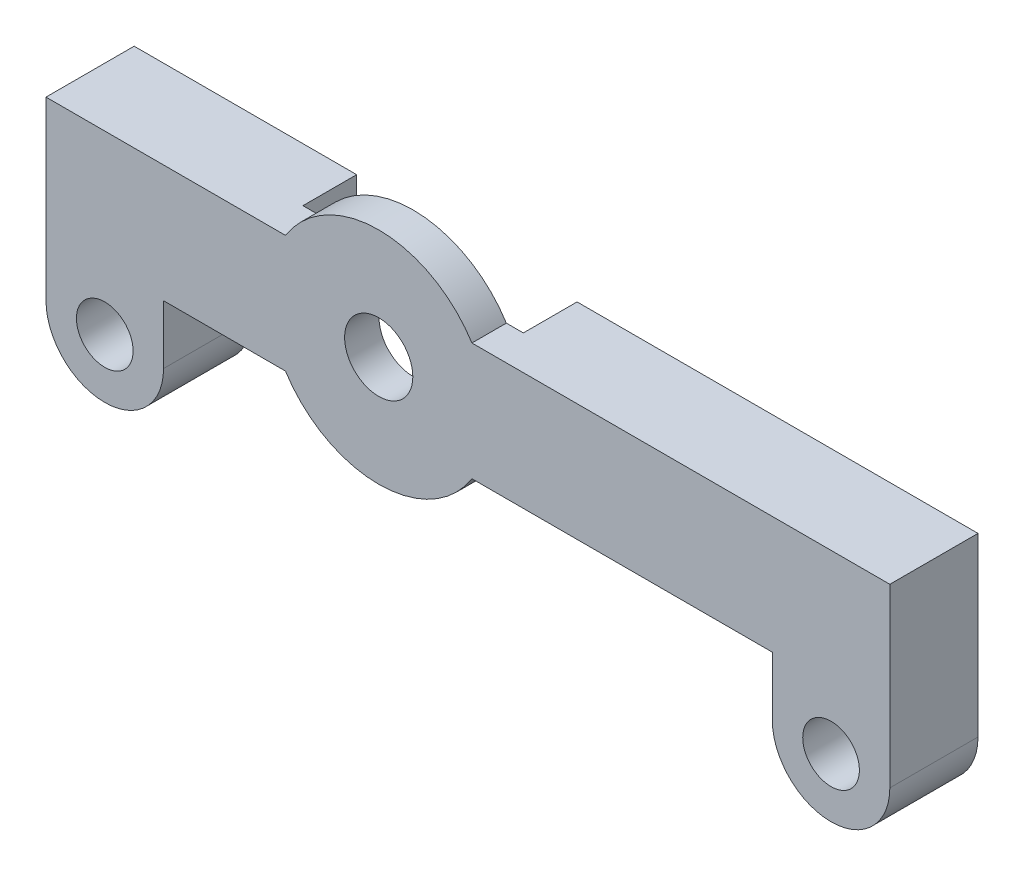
ISO-10303-21;
HEADER;
FILE_DESCRIPTION(('STEP AP214'),'2;1');
FILE_NAME('part.step','',(''),(''),'','','');
FILE_SCHEMA(('AUTOMOTIVE_DESIGN { 1 0 10303 214 1 1 1 1 }'));
ENDSEC;
DATA;
#1=APPLICATION_CONTEXT('core data for automotive mechanical design processes');
#2=APPLICATION_PROTOCOL_DEFINITION('international standard','automotive_design',2000,#1);
#3=PRODUCT_CONTEXT('',#1,'mechanical');
#4=PRODUCT('Part','Part','',(#3));
#5=PRODUCT_RELATED_PRODUCT_CATEGORY('part','',(#4));
#6=PRODUCT_DEFINITION_FORMATION('','',#4);
#7=PRODUCT_DEFINITION_CONTEXT('part definition',#1,'design');
#8=PRODUCT_DEFINITION('design','',#6,#7);
#9=PRODUCT_DEFINITION_SHAPE('','',#8);
#10=(LENGTH_UNIT() NAMED_UNIT(*) SI_UNIT(.MILLI.,.METRE.));
#11=(NAMED_UNIT(*) PLANE_ANGLE_UNIT() SI_UNIT($,.RADIAN.));
#12=(NAMED_UNIT(*) SI_UNIT($,.STERADIAN.) SOLID_ANGLE_UNIT());
#13=UNCERTAINTY_MEASURE_WITH_UNIT(LENGTH_MEASURE(1.E-05),#10,'distance_accuracy_value','');
#14=(GEOMETRIC_REPRESENTATION_CONTEXT(3) GLOBAL_UNCERTAINTY_ASSIGNED_CONTEXT((#13)) GLOBAL_UNIT_ASSIGNED_CONTEXT((#10,
#11,#12)) REPRESENTATION_CONTEXT('',''));
#15=CARTESIAN_POINT('',(0.,0.,0.));
#16=DIRECTION('',(0.,0.,1.));
#17=DIRECTION('',(1.,0.,0.));
#18=AXIS2_PLACEMENT_3D('',#15,#16,#17);
#19=CARTESIAN_POINT('',(-14.5,2.8,4.2));
#20=DIRECTION('',(0.,1.,0.));
#21=DIRECTION('',(0.,0.,1.));
#22=AXIS2_PLACEMENT_3D('',#19,#20,#21);
#23=PLANE('',#22);
#24=DIRECTION('',(-1.,0.,0.));
#25=VECTOR('',#24,1.);
#26=CARTESIAN_POINT('',(-9.5,2.8,2.56));
#27=LINE('',#26,#25);
#28=CARTESIAN_POINT('',(-8.69100213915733,2.8,2.56));
#29=VERTEX_POINT('',#28);
#30=CARTESIAN_POINT('',(-9.5,2.8,2.56));
#31=VERTEX_POINT('',#30);
#32=EDGE_CURVE('E380',#29,#31,#27,.T.);
#33=ORIENTED_EDGE('',*,*,#32,.F.);
#34=DIRECTION('',(0.,0.,1.));
#35=VECTOR('',#34,1.);
#36=CARTESIAN_POINT('',(-8.69100213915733,2.8,-12.2892424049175));
#37=LINE('',#36,#35);
#38=CARTESIAN_POINT('',(-8.69100213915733,2.8,4.2));
#39=VERTEX_POINT('',#38);
#40=EDGE_CURVE('E296',#29,#39,#37,.T.);
#41=ORIENTED_EDGE('',*,*,#40,.T.);
#42=DIRECTION('',(1.,0.,0.));
#43=VECTOR('',#42,1.);
#44=CARTESIAN_POINT('',(-14.5,2.8,4.2));
#45=LINE('',#44,#43);
#46=CARTESIAN_POINT('',(-14.5,2.8,4.2));
#47=VERTEX_POINT('',#46);
#48=EDGE_CURVE('E282',#47,#39,#45,.T.);
#49=ORIENTED_EDGE('',*,*,#48,.F.);
#50=DIRECTION('',(0.,0.,-1.));
#51=VECTOR('',#50,1.);
#52=CARTESIAN_POINT('',(-14.5,2.8,4.2));
#53=LINE('',#52,#51);
#54=CARTESIAN_POINT('',(-14.5,2.8,0.));
#55=VERTEX_POINT('',#54);
#56=EDGE_CURVE('E48',#47,#55,#53,.T.);
#57=ORIENTED_EDGE('',*,*,#56,.T.);
#58=DIRECTION('',(1.,0.,0.));
#59=VECTOR('',#58,1.);
#60=CARTESIAN_POINT('',(-14.5,2.8,0.));
#61=LINE('',#60,#59);
#62=CARTESIAN_POINT('',(-9.5,2.8,0.));
#63=VERTEX_POINT('',#62);
#64=EDGE_CURVE('E229',#55,#63,#61,.T.);
#65=ORIENTED_EDGE('',*,*,#64,.T.);
#66=DIRECTION('',(0.,0.,-1.));
#67=VECTOR('',#66,1.);
#68=CARTESIAN_POINT('',(-9.5,2.8,2.56));
#69=LINE('',#68,#67);
#70=EDGE_CURVE('E308',#31,#63,#69,.T.);
#71=ORIENTED_EDGE('',*,*,#70,.F.);
#72=EDGE_LOOP('',(#33,#41,#49,#57,#65,#71));
#73=FACE_BOUND('',#72,.T.);
#74=ADVANCED_FACE('F38',(#73),#23,.F.);
#75=CARTESIAN_POINT('',(-20.1,8.4,4.2));
#76=DIRECTION('',(0.,-1.,0.));
#77=DIRECTION('',(0.,0.,-1.));
#78=AXIS2_PLACEMENT_3D('',#75,#76,#77);
#79=PLANE('',#78);
#80=DIRECTION('',(1.,0.,0.));
#81=VECTOR('',#80,1.);
#82=CARTESIAN_POINT('',(-9.5,8.4,2.56));
#83=LINE('',#82,#81);
#84=CARTESIAN_POINT('',(0.191002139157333,8.4,2.56));
#85=VERTEX_POINT('',#84);
#86=CARTESIAN_POINT('',(1.,8.4,2.56));
#87=VERTEX_POINT('',#86);
#88=EDGE_CURVE('E199',#85,#87,#83,.T.);
#89=ORIENTED_EDGE('',*,*,#88,.F.);
#90=DIRECTION('',(0.,0.,1.));
#91=VECTOR('',#90,1.);
#92=CARTESIAN_POINT('',(0.191002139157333,8.4,-12.2892424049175));
#93=LINE('',#92,#91);
#94=CARTESIAN_POINT('',(0.191002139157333,8.4,4.2));
#95=VERTEX_POINT('',#94);
#96=EDGE_CURVE('E183',#85,#95,#93,.T.);
#97=ORIENTED_EDGE('',*,*,#96,.T.);
#98=DIRECTION('',(-1.,0.,0.));
#99=VECTOR('',#98,1.);
#100=CARTESIAN_POINT('',(-20.1,8.4,4.2));
#101=LINE('',#100,#99);
#102=CARTESIAN_POINT('',(20.1,8.4,4.2));
#103=VERTEX_POINT('',#102);
#104=EDGE_CURVE('E197',#103,#95,#101,.T.);
#105=ORIENTED_EDGE('',*,*,#104,.F.);
#106=DIRECTION('',(0.,0.,-1.));
#107=VECTOR('',#106,1.);
#108=CARTESIAN_POINT('',(20.1,8.4,4.2));
#109=LINE('',#108,#107);
#110=CARTESIAN_POINT('',(20.1,8.4,0.));
#111=VERTEX_POINT('',#110);
#112=EDGE_CURVE('E256',#103,#111,#109,.T.);
#113=ORIENTED_EDGE('',*,*,#112,.T.);
#114=DIRECTION('',(-1.,0.,0.));
#115=VECTOR('',#114,1.);
#116=CARTESIAN_POINT('',(-20.1,8.4,0.));
#117=LINE('',#116,#115);
#118=CARTESIAN_POINT('',(1.,8.4,0.));
#119=VERTEX_POINT('',#118);
#120=EDGE_CURVE('E243',#111,#119,#117,.T.);
#121=ORIENTED_EDGE('',*,*,#120,.T.);
#122=DIRECTION('',(0.,0.,-1.));
#123=VECTOR('',#122,1.);
#124=CARTESIAN_POINT('',(1.,8.4,2.56));
#125=LINE('',#124,#123);
#126=EDGE_CURVE('E315',#87,#119,#125,.T.);
#127=ORIENTED_EDGE('',*,*,#126,.F.);
#128=EDGE_LOOP('',(#89,#97,#105,#113,#121,#127));
#129=FACE_BOUND('',#128,.T.);
#130=ADVANCED_FACE('F195',(#129),#79,.F.);
#131=CARTESIAN_POINT('',(-17.3,0.,0.));
#132=DIRECTION('',(0.,0.,1.));
#133=DIRECTION('',(1.,0.,0.));
#134=AXIS2_PLACEMENT_3D('',#131,#132,#133);
#135=PLANE('',#134);
#136=CARTESIAN_POINT('',(-17.3,0.,0.));
#137=DIRECTION('',(0.,0.,1.));
#138=DIRECTION('',(1.,0.,0.));
#139=AXIS2_PLACEMENT_3D('',#136,#137,#138);
#140=CIRCLE('',#139,1.35);
#141=CARTESIAN_POINT('',(-15.95,0.,0.));
#142=VERTEX_POINT('',#141);
#143=EDGE_CURVE('E332',#142,#142,#140,.T.);
#144=ORIENTED_EDGE('',*,*,#143,.T.);
#145=EDGE_LOOP('',(#144));
#146=FACE_BOUND('',#145,.T.);
#147=CARTESIAN_POINT('',(-9.5,8.4,0.));
#148=VERTEX_POINT('',#147);
#149=CARTESIAN_POINT('',(-20.1,8.4,0.));
#150=VERTEX_POINT('',#149);
#151=EDGE_CURVE('E242',#148,#150,#117,.T.);
#152=ORIENTED_EDGE('',*,*,#151,.F.);
#153=DIRECTION('',(0.,1.,0.));
#154=VECTOR('',#153,1.);
#155=CARTESIAN_POINT('',(-9.5,2.8,0.));
#156=LINE('',#155,#154);
#157=EDGE_CURVE('E289',#63,#148,#156,.T.);
#158=ORIENTED_EDGE('',*,*,#157,.F.);
#159=ORIENTED_EDGE('',*,*,#64,.F.);
#160=DIRECTION('',(0.,1.,0.));
#161=VECTOR('',#160,1.);
#162=CARTESIAN_POINT('',(-14.5,0.,0.));
#163=LINE('',#162,#161);
#164=CARTESIAN_POINT('',(-14.5,0.,0.));
#165=VERTEX_POINT('',#164);
#166=EDGE_CURVE('E224',#165,#55,#163,.T.);
#167=ORIENTED_EDGE('',*,*,#166,.F.);
#168=CARTESIAN_POINT('',(-17.3,0.,0.));
#169=DIRECTION('',(0.,0.,1.));
#170=DIRECTION('',(1.,0.,0.));
#171=AXIS2_PLACEMENT_3D('',#168,#169,#170);
#172=CIRCLE('',#171,2.8);
#173=CARTESIAN_POINT('',(-20.1,0.,0.));
#174=VERTEX_POINT('',#173);
#175=EDGE_CURVE('E220',#174,#165,#172,.T.);
#176=ORIENTED_EDGE('',*,*,#175,.F.);
#177=DIRECTION('',(0.,-1.,0.));
#178=VECTOR('',#177,1.);
#179=CARTESIAN_POINT('',(-20.1,0.,0.));
#180=LINE('',#179,#178);
#181=EDGE_CURVE('E247',#150,#174,#180,.T.);
#182=ORIENTED_EDGE('',*,*,#181,.F.);
#183=EDGE_LOOP('',(#152,#158,#159,#167,#176,#182));
#184=FACE_BOUND('',#183,.T.);
#185=ADVANCED_FACE('F287',(#146,#184),#135,.F.);
#186=CARTESIAN_POINT('',(-4.25,5.6,4.2));
#187=DIRECTION('',(0.,0.,-1.));
#188=DIRECTION('',(-1.,0.,0.));
#189=AXIS2_PLACEMENT_3D('',#186,#187,#188);
#190=CYLINDRICAL_SURFACE('',#189,1.625);
#191=CARTESIAN_POINT('',(-4.25,5.6,4.2));
#192=DIRECTION('',(0.,0.,1.));
#193=DIRECTION('',(1.,0.,0.));
#194=AXIS2_PLACEMENT_3D('',#191,#192,#193);
#195=CIRCLE('',#194,1.625);
#196=CARTESIAN_POINT('',(-2.625,5.6,4.2));
#197=VERTEX_POINT('',#196);
#198=EDGE_CURVE('E325',#197,#197,#195,.T.);
#199=ORIENTED_EDGE('',*,*,#198,.T.);
#200=EDGE_LOOP('',(#199));
#201=FACE_BOUND('',#200,.T.);
#202=CARTESIAN_POINT('',(-4.25,5.6,2.56));
#203=DIRECTION('',(0.,0.,-1.));
#204=DIRECTION('',(-1.,0.,0.));
#205=AXIS2_PLACEMENT_3D('',#202,#203,#204);
#206=CIRCLE('',#205,1.625);
#207=CARTESIAN_POINT('',(-5.875,5.6,2.56));
#208=VERTEX_POINT('',#207);
#209=EDGE_CURVE('E42',#208,#208,#206,.T.);
#210=ORIENTED_EDGE('',*,*,#209,.T.);
#211=EDGE_LOOP('',(#210));
#212=FACE_BOUND('',#211,.T.);
#213=ADVANCED_FACE('F453',(#201,#212),#190,.F.);
#214=CARTESIAN_POINT('',(-17.3,0.,4.2));
#215=DIRECTION('',(0.,0.,1.));
#216=DIRECTION('',(1.,0.,0.));
#217=AXIS2_PLACEMENT_3D('',#214,#215,#216);
#218=PLANE('',#217);
#219=ORIENTED_EDGE('',*,*,#104,.T.);
#220=CARTESIAN_POINT('',(-4.25,5.6,4.2));
#221=DIRECTION('',(0.,0.,1.));
#222=DIRECTION('',(1.,0.,0.));
#223=AXIS2_PLACEMENT_3D('',#220,#221,#222);
#224=CIRCLE('',#223,5.25);
#225=CARTESIAN_POINT('',(-8.69100213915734,8.4,4.2));
#226=VERTEX_POINT('',#225);
#227=EDGE_CURVE('E180',#95,#226,#224,.T.);
#228=ORIENTED_EDGE('',*,*,#227,.T.);
#229=CARTESIAN_POINT('',(-20.1,8.4,4.2));
#230=VERTEX_POINT('',#229);
#231=EDGE_CURVE('E210',#226,#230,#101,.T.);
#232=ORIENTED_EDGE('',*,*,#231,.T.);
#233=DIRECTION('',(0.,-1.,0.));
#234=VECTOR('',#233,1.);
#235=CARTESIAN_POINT('',(-20.1,0.,4.2));
#236=LINE('',#235,#234);
#237=CARTESIAN_POINT('',(-20.1,0.,4.2));
#238=VERTEX_POINT('',#237);
#239=EDGE_CURVE('E209',#230,#238,#236,.T.);
#240=ORIENTED_EDGE('',*,*,#239,.T.);
#241=CARTESIAN_POINT('',(-17.3,0.,4.2));
#242=DIRECTION('',(0.,0.,1.));
#243=DIRECTION('',(1.,0.,0.));
#244=AXIS2_PLACEMENT_3D('',#241,#242,#243);
#245=CIRCLE('',#244,2.8);
#246=CARTESIAN_POINT('',(-14.5,0.,4.2));
#247=VERTEX_POINT('',#246);
#248=EDGE_CURVE('E249',#238,#247,#245,.T.);
#249=ORIENTED_EDGE('',*,*,#248,.T.);
#250=DIRECTION('',(0.,1.,0.));
#251=VECTOR('',#250,1.);
#252=CARTESIAN_POINT('',(-14.5,0.,4.2));
#253=LINE('',#252,#251);
#254=EDGE_CURVE('E341',#247,#47,#253,.T.);
#255=ORIENTED_EDGE('',*,*,#254,.T.);
#256=ORIENTED_EDGE('',*,*,#48,.T.);
#257=CARTESIAN_POINT('',(0.191002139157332,2.8,4.2));
#258=VERTEX_POINT('',#257);
#259=EDGE_CURVE('E191',#39,#258,#224,.T.);
#260=ORIENTED_EDGE('',*,*,#259,.T.);
#261=CARTESIAN_POINT('',(14.5,2.8,4.2));
#262=VERTEX_POINT('',#261);
#263=EDGE_CURVE('E344',#258,#262,#45,.T.);
#264=ORIENTED_EDGE('',*,*,#263,.T.);
#265=DIRECTION('',(0.,-1.,0.));
#266=VECTOR('',#265,1.);
#267=CARTESIAN_POINT('',(14.5,0.,4.2));
#268=LINE('',#267,#266);
#269=CARTESIAN_POINT('',(14.5,0.,4.2));
#270=VERTEX_POINT('',#269);
#271=EDGE_CURVE('E347',#262,#270,#268,.T.);
#272=ORIENTED_EDGE('',*,*,#271,.T.);
#273=CARTESIAN_POINT('',(17.3,0.,4.2));
#274=DIRECTION('',(0.,0.,1.));
#275=DIRECTION('',(-1.,0.,0.));
#276=AXIS2_PLACEMENT_3D('',#273,#274,#275);
#277=CIRCLE('',#276,2.8);
#278=CARTESIAN_POINT('',(20.1,0.,4.2));
#279=VERTEX_POINT('',#278);
#280=EDGE_CURVE('E349',#270,#279,#277,.T.);
#281=ORIENTED_EDGE('',*,*,#280,.T.);
#282=DIRECTION('',(0.,1.,0.));
#283=VECTOR('',#282,1.);
#284=CARTESIAN_POINT('',(20.1,0.,4.2));
#285=LINE('',#284,#283);
#286=EDGE_CURVE('E206',#279,#103,#285,.T.);
#287=ORIENTED_EDGE('',*,*,#286,.T.);
#288=EDGE_LOOP('',(#219,#228,#232,#240,#249,#255,#256,#260,#264,#272,#281,#287));
#289=FACE_BOUND('',#288,.T.);
#290=CARTESIAN_POINT('',(17.3,0.,4.2));
#291=DIRECTION('',(0.,0.,1.));
#292=DIRECTION('',(-1.,0.,0.));
#293=AXIS2_PLACEMENT_3D('',#290,#291,#292);
#294=CIRCLE('',#293,1.35);
#295=CARTESIAN_POINT('',(15.95,0.,4.2));
#296=VERTEX_POINT('',#295);
#297=EDGE_CURVE('E321',#296,#296,#294,.T.);
#298=ORIENTED_EDGE('',*,*,#297,.F.);
#299=EDGE_LOOP('',(#298));
#300=FACE_BOUND('',#299,.T.);
#301=ORIENTED_EDGE('',*,*,#198,.F.);
#302=EDGE_LOOP('',(#301));
#303=FACE_BOUND('',#302,.T.);
#304=CARTESIAN_POINT('',(-17.3,0.,4.2));
#305=DIRECTION('',(0.,0.,1.));
#306=DIRECTION('',(1.,0.,0.));
#307=AXIS2_PLACEMENT_3D('',#304,#305,#306);
#308=CIRCLE('',#307,1.35);
#309=CARTESIAN_POINT('',(-15.95,0.,4.2));
#310=VERTEX_POINT('',#309);
#311=EDGE_CURVE('E225',#310,#310,#308,.T.);
#312=ORIENTED_EDGE('',*,*,#311,.F.);
#313=EDGE_LOOP('',(#312));
#314=FACE_BOUND('',#313,.T.);
#315=ADVANCED_FACE('F203',(#289,#300,#303,#314),#218,.T.);
#316=CARTESIAN_POINT('',(1.,2.8,0.));
#317=VERTEX_POINT('',#316);
#318=CARTESIAN_POINT('',(14.5,2.8,0.));
#319=VERTEX_POINT('',#318);
#320=EDGE_CURVE('E228',#317,#319,#61,.T.);
#321=ORIENTED_EDGE('',*,*,#320,.F.);
#322=DIRECTION('',(0.,-1.,0.));
#323=VECTOR('',#322,1.);
#324=CARTESIAN_POINT('',(1.,2.8,0.));
#325=LINE('',#324,#323);
#326=EDGE_CURVE('E295',#119,#317,#325,.T.);
#327=ORIENTED_EDGE('',*,*,#326,.F.);
#328=ORIENTED_EDGE('',*,*,#120,.F.);
#329=DIRECTION('',(0.,1.,0.));
#330=VECTOR('',#329,1.);
#331=CARTESIAN_POINT('',(20.1,0.,0.));
#332=LINE('',#331,#330);
#333=CARTESIAN_POINT('',(20.1,0.,0.));
#334=VERTEX_POINT('',#333);
#335=EDGE_CURVE('E239',#334,#111,#332,.T.);
#336=ORIENTED_EDGE('',*,*,#335,.F.);
#337=CARTESIAN_POINT('',(17.3,0.,0.));
#338=DIRECTION('',(0.,0.,1.));
#339=DIRECTION('',(-1.,0.,0.));
#340=AXIS2_PLACEMENT_3D('',#337,#338,#339);
#341=CIRCLE('',#340,2.8);
#342=CARTESIAN_POINT('',(14.5,0.,0.));
#343=VERTEX_POINT('',#342);
#344=EDGE_CURVE('E236',#343,#334,#341,.T.);
#345=ORIENTED_EDGE('',*,*,#344,.F.);
#346=DIRECTION('',(0.,-1.,0.));
#347=VECTOR('',#346,1.);
#348=CARTESIAN_POINT('',(14.5,0.,0.));
#349=LINE('',#348,#347);
#350=EDGE_CURVE('E233',#319,#343,#349,.T.);
#351=ORIENTED_EDGE('',*,*,#350,.F.);
#352=EDGE_LOOP('',(#321,#327,#328,#336,#345,#351));
#353=FACE_BOUND('',#352,.T.);
#354=CARTESIAN_POINT('',(17.3,0.,0.));
#355=DIRECTION('',(0.,0.,1.));
#356=DIRECTION('',(-1.,0.,0.));
#357=AXIS2_PLACEMENT_3D('',#354,#355,#356);
#358=CIRCLE('',#357,1.35);
#359=CARTESIAN_POINT('',(15.95,0.,0.));
#360=VERTEX_POINT('',#359);
#361=EDGE_CURVE('E326',#360,#360,#358,.T.);
#362=ORIENTED_EDGE('',*,*,#361,.T.);
#363=EDGE_LOOP('',(#362));
#364=FACE_BOUND('',#363,.T.);
#365=ADVANCED_FACE('F366',(#353,#364),#135,.F.);
#366=CARTESIAN_POINT('',(-17.3,0.,4.2));
#367=DIRECTION('',(0.,0.,-1.));
#368=DIRECTION('',(-1.,0.,0.));
#369=AXIS2_PLACEMENT_3D('',#366,#367,#368);
#370=CYLINDRICAL_SURFACE('',#369,2.8);
#371=ORIENTED_EDGE('',*,*,#175,.T.);
#372=DIRECTION('',(0.,0.,-1.));
#373=VECTOR('',#372,1.);
#374=CARTESIAN_POINT('',(-14.5,0.,4.2));
#375=LINE('',#374,#373);
#376=EDGE_CURVE('E11',#247,#165,#375,.T.);
#377=ORIENTED_EDGE('',*,*,#376,.F.);
#378=ORIENTED_EDGE('',*,*,#248,.F.);
#379=DIRECTION('',(0.,0.,-1.));
#380=VECTOR('',#379,1.);
#381=CARTESIAN_POINT('',(-20.1,0.,4.2));
#382=LINE('',#381,#380);
#383=EDGE_CURVE('E214',#238,#174,#382,.T.);
#384=ORIENTED_EDGE('',*,*,#383,.T.);
#385=EDGE_LOOP('',(#371,#377,#378,#384));
#386=FACE_BOUND('',#385,.T.);
#387=ADVANCED_FACE('F40',(#386),#370,.T.);
#388=CARTESIAN_POINT('',(-14.5,0.,4.2));
#389=DIRECTION('',(-1.,0.,0.));
#390=DIRECTION('',(0.,0.,1.));
#391=AXIS2_PLACEMENT_3D('',#388,#389,#390);
#392=PLANE('',#391);
#393=ORIENTED_EDGE('',*,*,#166,.T.);
#394=ORIENTED_EDGE('',*,*,#56,.F.);
#395=ORIENTED_EDGE('',*,*,#254,.F.);
#396=ORIENTED_EDGE('',*,*,#376,.T.);
#397=EDGE_LOOP('',(#393,#394,#395,#396));
#398=FACE_BOUND('',#397,.T.);
#399=ADVANCED_FACE('F410',(#398),#392,.F.);
#400=ORIENTED_EDGE('',*,*,#263,.F.);
#401=DIRECTION('',(0.,0.,1.));
#402=VECTOR('',#401,1.);
#403=CARTESIAN_POINT('',(0.191002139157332,2.8,-12.2892424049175));
#404=LINE('',#403,#402);
#405=CARTESIAN_POINT('',(0.191002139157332,2.8,2.56));
#406=VERTEX_POINT('',#405);
#407=EDGE_CURVE('E201',#258,#406,#404,.F.);
#408=ORIENTED_EDGE('',*,*,#407,.T.);
#409=CARTESIAN_POINT('',(1.,2.8,2.56));
#410=VERTEX_POINT('',#409);
#411=EDGE_CURVE('E305',#410,#406,#27,.T.);
#412=ORIENTED_EDGE('',*,*,#411,.F.);
#413=DIRECTION('',(0.,0.,-1.));
#414=VECTOR('',#413,1.);
#415=CARTESIAN_POINT('',(1.,2.8,2.56));
#416=LINE('',#415,#414);
#417=EDGE_CURVE('E311',#410,#317,#416,.T.);
#418=ORIENTED_EDGE('',*,*,#417,.T.);
#419=ORIENTED_EDGE('',*,*,#320,.T.);
#420=DIRECTION('',(0.,0.,-1.));
#421=VECTOR('',#420,1.);
#422=CARTESIAN_POINT('',(14.5,2.8,4.2));
#423=LINE('',#422,#421);
#424=EDGE_CURVE('E267',#262,#319,#423,.T.);
#425=ORIENTED_EDGE('',*,*,#424,.F.);
#426=EDGE_LOOP('',(#400,#408,#412,#418,#419,#425));
#427=FACE_BOUND('',#426,.T.);
#428=ADVANCED_FACE('F376',(#427),#23,.F.);
#429=CARTESIAN_POINT('',(14.5,0.,4.2));
#430=DIRECTION('',(1.,0.,0.));
#431=DIRECTION('',(0.,0.,-1.));
#432=AXIS2_PLACEMENT_3D('',#429,#430,#431);
#433=PLANE('',#432);
#434=ORIENTED_EDGE('',*,*,#350,.T.);
#435=DIRECTION('',(0.,0.,-1.));
#436=VECTOR('',#435,1.);
#437=CARTESIAN_POINT('',(14.5,0.,4.2));
#438=LINE('',#437,#436);
#439=EDGE_CURVE('E263',#270,#343,#438,.T.);
#440=ORIENTED_EDGE('',*,*,#439,.F.);
#441=ORIENTED_EDGE('',*,*,#271,.F.);
#442=ORIENTED_EDGE('',*,*,#424,.T.);
#443=EDGE_LOOP('',(#434,#440,#441,#442));
#444=FACE_BOUND('',#443,.T.);
#445=ADVANCED_FACE('F402',(#444),#433,.F.);
#446=CARTESIAN_POINT('',(17.3,0.,4.2));
#447=DIRECTION('',(0.,0.,-1.));
#448=DIRECTION('',(-1.,0.,0.));
#449=AXIS2_PLACEMENT_3D('',#446,#447,#448);
#450=CYLINDRICAL_SURFACE('',#449,2.8);
#451=ORIENTED_EDGE('',*,*,#344,.T.);
#452=DIRECTION('',(0.,0.,-1.));
#453=VECTOR('',#452,1.);
#454=CARTESIAN_POINT('',(20.1,0.,4.2));
#455=LINE('',#454,#453);
#456=EDGE_CURVE('E259',#279,#334,#455,.T.);
#457=ORIENTED_EDGE('',*,*,#456,.F.);
#458=ORIENTED_EDGE('',*,*,#280,.F.);
#459=ORIENTED_EDGE('',*,*,#439,.T.);
#460=EDGE_LOOP('',(#451,#457,#458,#459));
#461=FACE_BOUND('',#460,.T.);
#462=ADVANCED_FACE('F357',(#461),#450,.T.);
#463=CARTESIAN_POINT('',(20.1,0.,4.2));
#464=DIRECTION('',(-1.,0.,0.));
#465=DIRECTION('',(0.,0.,1.));
#466=AXIS2_PLACEMENT_3D('',#463,#464,#465);
#467=PLANE('',#466);
#468=ORIENTED_EDGE('',*,*,#335,.T.);
#469=ORIENTED_EDGE('',*,*,#112,.F.);
#470=ORIENTED_EDGE('',*,*,#286,.F.);
#471=ORIENTED_EDGE('',*,*,#456,.T.);
#472=EDGE_LOOP('',(#468,#469,#470,#471));
#473=FACE_BOUND('',#472,.T.);
#474=ADVANCED_FACE('F361',(#473),#467,.F.);
#475=ORIENTED_EDGE('',*,*,#231,.F.);
#476=DIRECTION('',(0.,0.,1.));
#477=VECTOR('',#476,1.);
#478=CARTESIAN_POINT('',(-8.69100213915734,8.4,-12.2892424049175));
#479=LINE('',#478,#477);
#480=CARTESIAN_POINT('',(-8.69100213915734,8.4,2.56));
#481=VERTEX_POINT('',#480);
#482=EDGE_CURVE('E186',#226,#481,#479,.F.);
#483=ORIENTED_EDGE('',*,*,#482,.T.);
#484=CARTESIAN_POINT('',(-9.5,8.4,2.56));
#485=VERTEX_POINT('',#484);
#486=EDGE_CURVE('E388',#485,#481,#83,.T.);
#487=ORIENTED_EDGE('',*,*,#486,.F.);
#488=DIRECTION('',(0.,0.,-1.));
#489=VECTOR('',#488,1.);
#490=CARTESIAN_POINT('',(-9.5,8.4,2.56));
#491=LINE('',#490,#489);
#492=EDGE_CURVE('E318',#485,#148,#491,.T.);
#493=ORIENTED_EDGE('',*,*,#492,.T.);
#494=ORIENTED_EDGE('',*,*,#151,.T.);
#495=DIRECTION('',(0.,0.,-1.));
#496=VECTOR('',#495,1.);
#497=CARTESIAN_POINT('',(-20.1,8.4,4.2));
#498=LINE('',#497,#496);
#499=EDGE_CURVE('E253',#230,#150,#498,.T.);
#500=ORIENTED_EDGE('',*,*,#499,.F.);
#501=EDGE_LOOP('',(#475,#483,#487,#493,#494,#500));
#502=FACE_BOUND('',#501,.T.);
#503=ADVANCED_FACE('F417',(#502),#79,.F.);
#504=CARTESIAN_POINT('',(-20.1,0.,4.2));
#505=DIRECTION('',(1.,0.,0.));
#506=DIRECTION('',(0.,0.,-1.));
#507=AXIS2_PLACEMENT_3D('',#504,#505,#506);
#508=PLANE('',#507);
#509=ORIENTED_EDGE('',*,*,#181,.T.);
#510=ORIENTED_EDGE('',*,*,#383,.F.);
#511=ORIENTED_EDGE('',*,*,#239,.F.);
#512=ORIENTED_EDGE('',*,*,#499,.T.);
#513=EDGE_LOOP('',(#509,#510,#511,#512));
#514=FACE_BOUND('',#513,.T.);
#515=ADVANCED_FACE('F427',(#514),#508,.F.);
#516=CARTESIAN_POINT('',(-17.3,0.,4.2));
#517=DIRECTION('',(0.,0.,-1.));
#518=DIRECTION('',(-1.,0.,0.));
#519=AXIS2_PLACEMENT_3D('',#516,#517,#518);
#520=CYLINDRICAL_SURFACE('',#519,1.35);
#521=ORIENTED_EDGE('',*,*,#311,.T.);
#522=EDGE_LOOP('',(#521));
#523=FACE_BOUND('',#522,.T.);
#524=ORIENTED_EDGE('',*,*,#143,.F.);
#525=EDGE_LOOP('',(#524));
#526=FACE_BOUND('',#525,.T.);
#527=ADVANCED_FACE('F451',(#523,#526),#520,.F.);
#528=CARTESIAN_POINT('',(17.3,0.,4.2));
#529=DIRECTION('',(0.,0.,-1.));
#530=DIRECTION('',(-1.,0.,0.));
#531=AXIS2_PLACEMENT_3D('',#528,#529,#530);
#532=CYLINDRICAL_SURFACE('',#531,1.35);
#533=ORIENTED_EDGE('',*,*,#297,.T.);
#534=EDGE_LOOP('',(#533));
#535=FACE_BOUND('',#534,.T.);
#536=ORIENTED_EDGE('',*,*,#361,.F.);
#537=EDGE_LOOP('',(#536));
#538=FACE_BOUND('',#537,.T.);
#539=ADVANCED_FACE('F448',(#535,#538),#532,.F.);
#540=CARTESIAN_POINT('',(-9.5,2.8,2.56));
#541=DIRECTION('',(-1.,0.,0.));
#542=DIRECTION('',(0.,0.,1.));
#543=AXIS2_PLACEMENT_3D('',#540,#541,#542);
#544=PLANE('',#543);
#545=ORIENTED_EDGE('',*,*,#157,.T.);
#546=ORIENTED_EDGE('',*,*,#492,.F.);
#547=DIRECTION('',(0.,1.,0.));
#548=VECTOR('',#547,1.);
#549=CARTESIAN_POINT('',(-9.5,2.8,2.56));
#550=LINE('',#549,#548);
#551=EDGE_CURVE('E300',#31,#485,#550,.T.);
#552=ORIENTED_EDGE('',*,*,#551,.F.);
#553=ORIENTED_EDGE('',*,*,#70,.T.);
#554=EDGE_LOOP('',(#545,#546,#552,#553));
#555=FACE_BOUND('',#554,.T.);
#556=ADVANCED_FACE('F433',(#555),#544,.F.);
#557=CARTESIAN_POINT('',(1.,2.8,2.56));
#558=DIRECTION('',(1.,0.,0.));
#559=DIRECTION('',(0.,0.,-1.));
#560=AXIS2_PLACEMENT_3D('',#557,#558,#559);
#561=PLANE('',#560);
#562=ORIENTED_EDGE('',*,*,#326,.T.);
#563=ORIENTED_EDGE('',*,*,#417,.F.);
#564=DIRECTION('',(0.,-1.,0.));
#565=VECTOR('',#564,1.);
#566=CARTESIAN_POINT('',(1.,2.8,2.56));
#567=LINE('',#566,#565);
#568=EDGE_CURVE('E384',#87,#410,#567,.T.);
#569=ORIENTED_EDGE('',*,*,#568,.F.);
#570=ORIENTED_EDGE('',*,*,#126,.T.);
#571=EDGE_LOOP('',(#562,#563,#569,#570));
#572=FACE_BOUND('',#571,.T.);
#573=ADVANCED_FACE('F371',(#572),#561,.F.);
#574=CARTESIAN_POINT('',(0.,0.,2.56));
#575=DIRECTION('',(0.,0.,-1.));
#576=DIRECTION('',(-1.,0.,0.));
#577=AXIS2_PLACEMENT_3D('',#574,#575,#576);
#578=PLANE('',#577);
#579=ORIENTED_EDGE('',*,*,#551,.T.);
#580=ORIENTED_EDGE('',*,*,#486,.T.);
#581=CARTESIAN_POINT('',(-4.25,5.6,2.56));
#582=DIRECTION('',(0.,0.,-1.));
#583=DIRECTION('',(-1.,0.,0.));
#584=AXIS2_PLACEMENT_3D('',#581,#582,#583);
#585=CIRCLE('',#584,5.25);
#586=EDGE_CURVE('E68',#85,#481,#585,.F.);
#587=ORIENTED_EDGE('',*,*,#586,.F.);
#588=ORIENTED_EDGE('',*,*,#88,.T.);
#589=ORIENTED_EDGE('',*,*,#568,.T.);
#590=ORIENTED_EDGE('',*,*,#411,.T.);
#591=EDGE_CURVE('E58',#29,#406,#585,.F.);
#592=ORIENTED_EDGE('',*,*,#591,.F.);
#593=ORIENTED_EDGE('',*,*,#32,.T.);
#594=EDGE_LOOP('',(#579,#580,#587,#588,#589,#590,#592,#593));
#595=FACE_BOUND('',#594,.T.);
#596=ORIENTED_EDGE('',*,*,#209,.F.);
#597=EDGE_LOOP('',(#596));
#598=FACE_BOUND('',#597,.T.);
#599=ADVANCED_FACE('F440',(#595,#598),#578,.T.);
#600=CARTESIAN_POINT('',(-4.25,5.6,-12.2892424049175));
#601=DIRECTION('',(0.,0.,1.));
#602=DIRECTION('',(1.,0.,0.));
#603=AXIS2_PLACEMENT_3D('',#600,#601,#602);
#604=CYLINDRICAL_SURFACE('',#603,5.25);
#605=ORIENTED_EDGE('',*,*,#96,.F.);
#606=ORIENTED_EDGE('',*,*,#586,.T.);
#607=ORIENTED_EDGE('',*,*,#482,.F.);
#608=ORIENTED_EDGE('',*,*,#227,.F.);
#609=EDGE_LOOP('',(#605,#606,#607,#608));
#610=FACE_BOUND('',#609,.T.);
#611=ADVANCED_FACE('F182',(#610),#604,.T.);
#612=ORIENTED_EDGE('',*,*,#40,.F.);
#613=ORIENTED_EDGE('',*,*,#591,.T.);
#614=ORIENTED_EDGE('',*,*,#407,.F.);
#615=ORIENTED_EDGE('',*,*,#259,.F.);
#616=EDGE_LOOP('',(#612,#613,#614,#615));
#617=FACE_BOUND('',#616,.T.);
#618=ADVANCED_FACE('F434',(#617),#604,.T.);
#619=CLOSED_SHELL('',(#74,#130,#185,#213,#315,#365,#387,#399,#428,#445,#462,#474,#503,#515,#527,
#539,#556,#573,#599,#611,#618));
#620=MANIFOLD_SOLID_BREP('B2',#619);
#621=ADVANCED_BREP_SHAPE_REPRESENTATION('',(#18,#620),#14);
#622=SHAPE_DEFINITION_REPRESENTATION(#9,#621);
ENDSEC;
END-ISO-10303-21;
